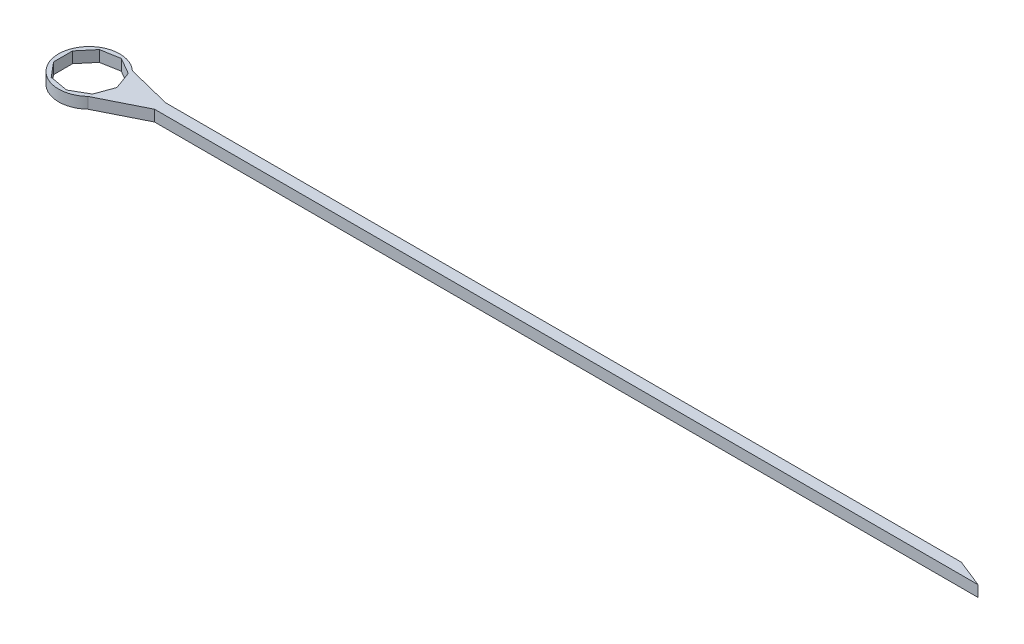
from build123d import *

# Parameters (mm, degrees)
BOSS_EXTRUDE1_DEPTH = 1


with BuildPart() as part:
    # Sketch1 → Boss-Extrude1 (new body)
    with BuildSketch(Plane(origin=(0, 0, 0), x_dir=(1, 0, 0), z_dir=(0, 1, 0))):
        with BuildLine():
            Line((5.887458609, 0), (80, 0))
            Line((80, 0), (77.5, 1))
            Line((77.5, 1), (5.887458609, 1))
            Line((5.887458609, 1), (1.887458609, 2))
            ThreePointArc((1.887458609, 2), (-2.75, 0), (1.887458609, -2))
            Line((1.887458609, -2), (5.887458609, 0))
        make_face()
        Polygon((2.5, 0), (1.915111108, 1.606969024), (0.434120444, 2.462019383), (-1.25, 2.165063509), (-2.349231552, 0.855050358), (-2.349231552, -0.855050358), (-1.25, -2.165063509), (0.434120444, -2.462019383), (1.915111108, -1.606969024), align=None, mode=Mode.SUBTRACT)
    extrude(amount=BOSS_EXTRUDE1_DEPTH)


solid = part.part
